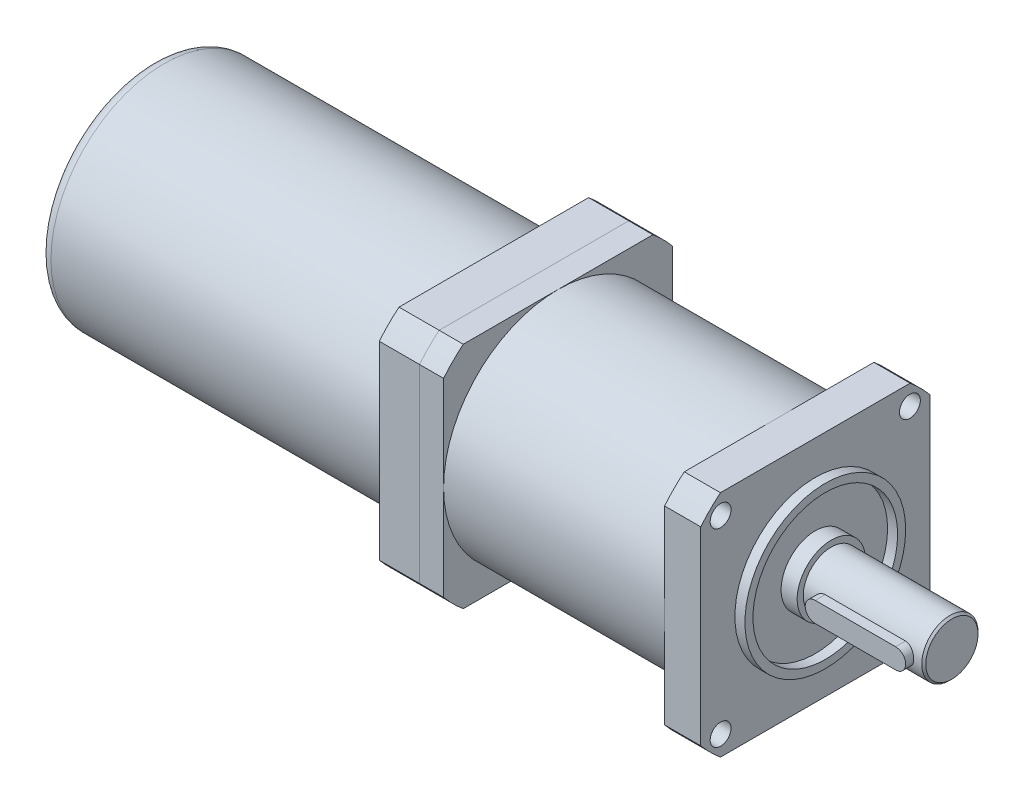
from build123d import *

# Parameters (mm, degrees)
EXTRUDE_1_DEPTH     = 9
SKETCH_2_R          = 28.5
EXTRUDE_2_DEPTH     = 55
EXTRUDE_3_DEPTH     = 6
SKETCH_6_R          = 2.6
CUT_EXTRUDE_2_DEPTH = 9
SKETCH_7_R          = 20
SKETCH_7_R_2        = 18
EXTRUDE_5_DEPTH     = 2.5
SKETCH_8_R          = 8.5
EXTRUDE_6_DEPTH     = 4
SKETCH_9_R          = 7
EXTRUDE_7_DEPTH     = 30
CUT_EXTRUDE_3_DEPTH = 3
EXTRUDE_START       = 5
EXTRUDE_8_DEPTH     = 5
CHAMFER_1_SIZE      = 0.5
EXTRUDE_9_DEPTH     = 10
SKETCH_15_R         = 28.2
EXTRUDE_10_DEPTH    = 85
FILLET_1_R          = 3


with BuildPart() as part:
    # Sketch 1 → Extrude 1 (new body)
    with BuildSketch(Plane(origin=(0, 0, 0), x_dir=(0, 0, -1), z_dir=(1, 0, 0))):
        with BuildLine():
            Line((-23.595550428, -28.5), (23.595550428, -28.5))
            ThreePointArc((23.595550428, -28.5), (26.162950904, -26.162950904), (28.5, -23.595550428))
            Line((28.5, -23.595550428), (28.5, 23.595550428))
            ThreePointArc((28.5, 23.595550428), (26.162950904, 26.162950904), (23.595550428, 28.5))
            Line((23.595550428, 28.5), (-23.595550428, 28.5))
            ThreePointArc((-23.595550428, 28.5), (-26.162950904, 26.162950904), (-28.5, 23.595550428))
            Line((-28.5, 23.595550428), (-28.5, -23.595550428))
            ThreePointArc((-28.5, -23.595550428), (-26.162950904, -26.162950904), (-23.595550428, -28.5))
        make_face()
    extrude(amount=-EXTRUDE_1_DEPTH)

    # Sketch 2 → Extrude 2 (add)
    with BuildSketch(Plane.ZY.offset(9)):
        Circle(SKETCH_2_R)
    extrude(amount=EXTRUDE_2_DEPTH)

    # Sketch 3 → Extrude 3 (add)
    with BuildSketch(Plane.ZY.offset(64)):
        with BuildLine():
            Line((-23.595550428, -28.5), (23.595550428, -28.5))
            ThreePointArc((23.595550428, -28.5), (26.162950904, -26.162950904), (28.5, -23.595550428))
            Line((28.5, -23.595550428), (28.5, 23.595550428))
            ThreePointArc((28.5, 23.595550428), (26.162950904, 26.162950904), (23.595550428, 28.5))
            Line((23.595550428, 28.5), (-23.595550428, 28.5))
            ThreePointArc((-23.595550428, 28.5), (-26.162950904, 26.162950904), (-28.5, 23.595550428))
            Line((-28.5, 23.595550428), (-28.5, -23.595550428))
            ThreePointArc((-28.5, -23.595550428), (-26.162950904, -26.162950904), (-23.595550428, -28.5))
        make_face()
    extrude(amount=EXTRUDE_3_DEPTH)

    # Sketch 6 → Cut-Extrude 2 (cut)
    with BuildSketch(Plane(origin=(0, 0, 0), x_dir=(0, 0, -1), z_dir=(1, 0, 0))):
        with Locations((-23.55, 23.55)):
            Circle(SKETCH_6_R)
        with Locations((23.55, 23.55)):
            Circle(SKETCH_6_R)
        with Locations((23.55, -23.55)):
            Circle(SKETCH_6_R)
        with Locations((-23.55, -23.55)):
            Circle(SKETCH_6_R)
    extrude(amount=-CUT_EXTRUDE_2_DEPTH, mode=Mode.SUBTRACT)

    # Sketch 7 → Extrude 5 (add)
    with BuildSketch(Plane(origin=(0, 0, 0), x_dir=(0, 0, -1), z_dir=(1, 0, 0))):
        Circle(SKETCH_7_R)
        Circle(SKETCH_7_R_2, mode=Mode.SUBTRACT)
    extrude(amount=EXTRUDE_5_DEPTH)

    # Sketch 8 → Extrude 6 (add)
    with BuildSketch(Plane(origin=(0, 0, 0), x_dir=(0, 0, -1), z_dir=(1, 0, 0))):
        Circle(SKETCH_8_R)
    extrude(amount=EXTRUDE_6_DEPTH)

    # Sketch 9 → Extrude 7 (add)
    with BuildSketch(Plane(origin=(4, 0, 0), x_dir=(0, 0, -1), z_dir=(1, 0, 0))):
        Circle(SKETCH_9_R)
    extrude(amount=EXTRUDE_7_DEPTH)

    # Sketch 10 → Cut-Extrude 3 (cut)
    with BuildSketch(Plane.XY.offset(7)):
        with BuildLine():
            Line((9, 2.5), (29, 2.5))
            ThreePointArc((29, 2.5), (31.5, 0), (29, -2.5))
            Line((29, -2.5), (9, -2.5))
            ThreePointArc((9, -2.5), (6.5, 0), (9, 2.5))
        make_face()
    extrude(amount=-CUT_EXTRUDE_3_DEPTH, mode=Mode.SUBTRACT)

    # Sketch 11 → Extrude 8 (add)
    with BuildSketch(Plane.XY.offset(4).offset(EXTRUDE_START)):
        with BuildLine():
            Line((9, 2.5), (29, 2.5))
            ThreePointArc((29, 2.5), (31.5, 0), (29, -2.5))
            Line((29, -2.5), (9, -2.5))
            ThreePointArc((9, -2.5), (6.5, 0), (9, 2.5))
        make_face()
    extrude(amount=-EXTRUDE_8_DEPTH)

    # Chamfer 1
    chamfer_1_edges = [part.edges().sort_by_distance(p)[0] for p in [
        (34, 0, 7),
    ]]
    chamfer(chamfer_1_edges, length=CHAMFER_1_SIZE)


with BuildPart() as body_2:
    # Sketch 14 → Extrude 9 (new body)
    with BuildSketch(Plane.ZY.offset(70)):
        with BuildLine():
            Line((-23.595550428, -28.5), (23.595550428, -28.5))
            ThreePointArc((23.595550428, -28.5), (26.162950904, -26.162950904), (28.5, -23.595550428))
            Line((28.5, -23.595550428), (28.5, 23.595550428))
            ThreePointArc((28.5, 23.595550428), (26.162950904, 26.162950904), (23.595550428, 28.5))
            Line((23.595550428, 28.5), (-23.595550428, 28.5))
            ThreePointArc((-23.595550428, 28.5), (-26.162950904, 26.162950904), (-28.5, 23.595550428))
            Line((-28.5, 23.595550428), (-28.5, -23.595550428))
            ThreePointArc((-28.5, -23.595550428), (-26.162950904, -26.162950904), (-23.595550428, -28.5))
        make_face()
    extrude(amount=EXTRUDE_9_DEPTH)

    # Sketch 15 → Extrude 10 (add)
    with BuildSketch(Plane.ZY.offset(80)):
        Circle(SKETCH_15_R)
    extrude(amount=EXTRUDE_10_DEPTH)

    # Fillet 1
    fillet_1_edges = [body_2.edges().sort_by_distance(p)[0] for p in [
        (-165, 0, -28.2),
    ]]
    fillet(fillet_1_edges, radius=FILLET_1_R)


solid = Compound([part.part, body_2.part])
